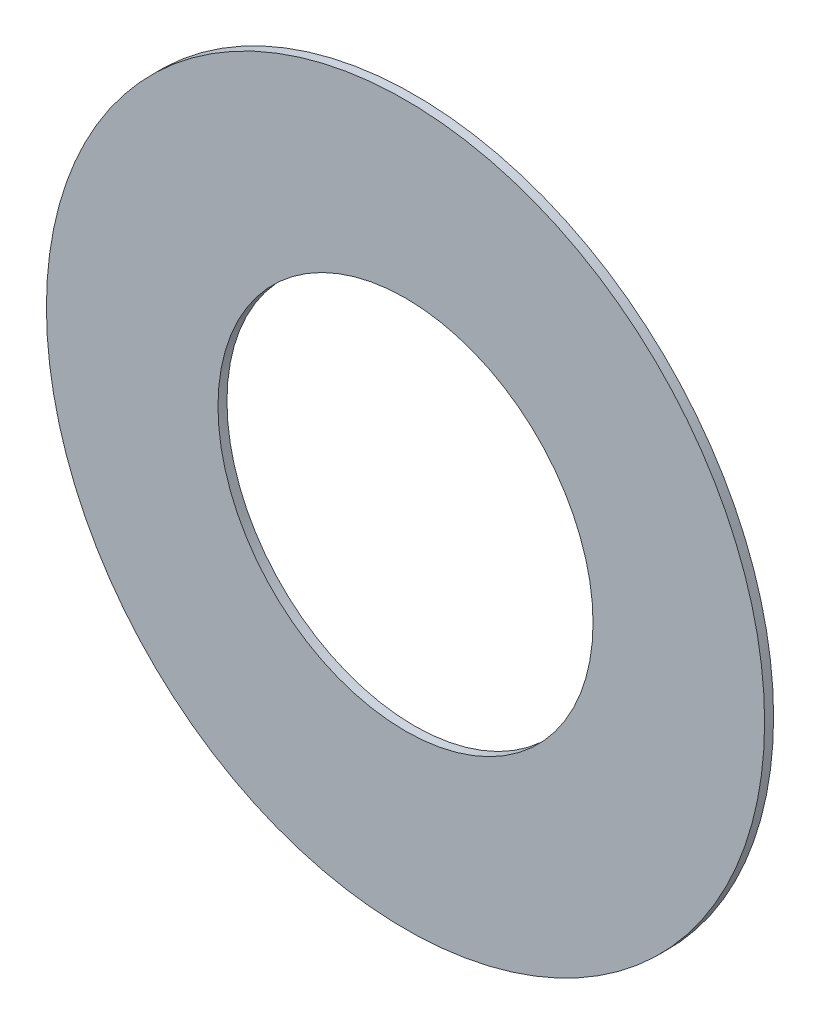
from build123d import *

# Parameters (mm, degrees)
SKETCH1_R          = 457.2
BASE_EXTRUDE_DEPTH = 11.43
SKETCH2_R          = 238.76
CUT_EXTRUDE1_DEPTH = 647.679460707


with BuildPart() as part:
    # Sketch1 → Base-Extrude (new body)
    with BuildSketch(Plane.XY):
        Circle(SKETCH1_R)
    extrude(amount=BASE_EXTRUDE_DEPTH)

    # Sketch2 → Cut-Extrude1 (cut, through all)
    with BuildSketch(Plane.XY.offset(11.43)):
        Circle(SKETCH2_R)
    extrude(amount=-CUT_EXTRUDE1_DEPTH, mode=Mode.SUBTRACT)


solid = part.part
